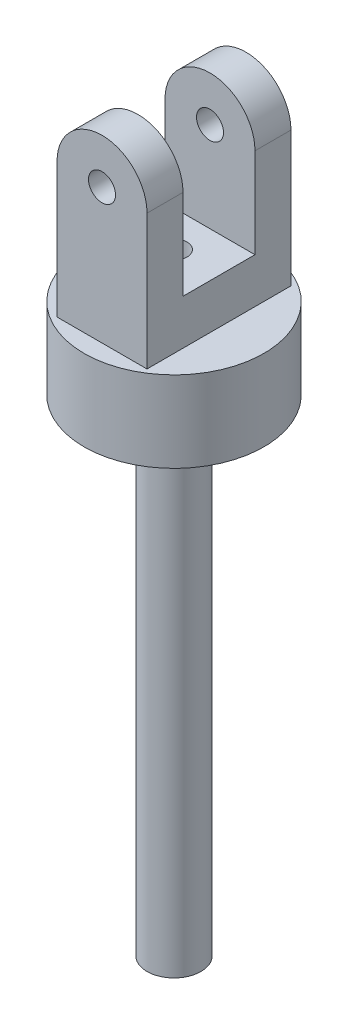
from build123d import *

# Parameters (mm, degrees)
SKETCH_1_W          = 10
SKETCH_1_H          = 4
EXTRUDE_1_DEPTH     = 15
EXTRUDE_1_2_DEPTH   = 15
SKETCH_1_4_W        = 10
SKETCH_1_4_H        = 8
SKETCH_1_4_H_2      = 4
EXTRUDE_2_DEPTH     = 4
CUT_EXTRUDE_3_REACH = 28.944
SKETCH_2_R          = 1.5
SKETCH_3_R          = 3
EXTRUDE_3_DEPTH     = 64
SKETCH_4_W          = 10
SKETCH_4_H          = 16
EXTRUDE_4_DEPTH     = 1
SKETCH_5_R          = 3
EXTRUDE_5_DEPTH     = 4
SKETCH_5_3_R        = 10
EXTRUDE_6_DEPTH     = 9
SKETCH_6_R          = 1.45
CUT_EXTRUDE_6_DEPTH = 87.332609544


with BuildPart() as part:
    # Sketch 1 → Extrude 1 (new body)
    with BuildSketch(Plane(origin=(0, 0, 0), x_dir=(1, 0, 0), z_dir=(0, 1, 0))):
        with Locations((-10.652173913, 4.260869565)):
            Rectangle(SKETCH_1_W, SKETCH_1_H)
    extrude(amount=EXTRUDE_1_DEPTH)



with BuildPart() as body_2:
    # Sketch 1 → Extrude 1 2 (new body)
    with BuildSketch(Plane(origin=(0, 0, 0), x_dir=(1, 0, 0), z_dir=(0, 1, 0))):
        with Locations((-10.652173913, -7.739130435)):
            Rectangle(SKETCH_1_W, SKETCH_1_H)
    extrude(amount=EXTRUDE_1_2_DEPTH)


with BuildPart() as part_1:
    add(part.part)

    add(body_2.part)  # Extrude 2 merges body 2
    # Sketch 1_4 → Extrude 2 (add)
    with BuildSketch(Plane(origin=(0, 0, 0), x_dir=(1, 0, 0), z_dir=(0, 1, 0))):
        with Locations((-10.652173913, -1.739130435)):
            Rectangle(SKETCH_1_4_W, SKETCH_1_4_H)
        with Locations((-10.652173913, -7.739130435)):
            Rectangle(SKETCH_1_4_W, SKETCH_1_4_H_2)
        with Locations((-10.652173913, 4.260869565)):
            Rectangle(SKETCH_1_4_W, SKETCH_1_4_H_2)
    extrude(amount=-EXTRUDE_2_DEPTH)

    # Cut-Extrude 3: up to this face of the body (flat: up to its plane)
    cut_extrude_3_end = Plane(part_1.part.faces().sort_by_distance((-10.652173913, 5.5, -6.260869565))[0])
    # Sketch 2 → Cut-Extrude 3 (cut, up to the picked face)
    with BuildSketch(Plane.XY.offset(9.739130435), mode=Mode.PRIVATE) as cut_extrude_3_sk1:
        with Locations((-10.652173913, 10)):
            Circle(SKETCH_2_R)
    cut_extrude_3_tool1 = split(extrude(cut_extrude_3_sk1.sketch, amount=-CUT_EXTRUDE_3_REACH, mode=Mode.PRIVATE), bisect_by=cut_extrude_3_end, keep=Keep.BOTH, mode=Mode.PRIVATE)
    # Sketch 2 → Cut-Extrude 3 (cut, up to the picked face)
    with BuildSketch(Plane.XY.offset(9.739130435), mode=Mode.PRIVATE) as cut_extrude_3_sk2:
        with BuildLine():
            Line((-15.652173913, 15), (-15.652173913, 10))
            ThreePointArc((-15.652173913, 10), (-14.187707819, 13.535533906), (-10.652173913, 15))
            Line((-10.652173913, 15), (-15.652173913, 15))
        make_face()
    cut_extrude_3_tool2 = split(extrude(cut_extrude_3_sk2.sketch, amount=-CUT_EXTRUDE_3_REACH, mode=Mode.PRIVATE), bisect_by=cut_extrude_3_end, keep=Keep.BOTH, mode=Mode.PRIVATE)
    # Sketch 2 → Cut-Extrude 3 (cut, up to the picked face)
    with BuildSketch(Plane.XY.offset(9.739130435), mode=Mode.PRIVATE) as cut_extrude_3_sk3:
        with BuildLine():
            ThreePointArc((-10.652173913, 15), (-7.116640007, 13.535533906), (-5.652173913, 10))
            Line((-5.652173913, 10), (-5.652173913, 15))
            Line((-5.652173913, 15), (-10.652173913, 15))
        make_face()
    cut_extrude_3_tool3 = split(extrude(cut_extrude_3_sk3.sketch, amount=-CUT_EXTRUDE_3_REACH, mode=Mode.PRIVATE), bisect_by=cut_extrude_3_end, keep=Keep.BOTH, mode=Mode.PRIVATE)
    add(cut_extrude_3_tool1.solids().sort_by(Axis((-10.652174, 10, 9.73913), (0, 0, -1)))[0], mode=Mode.SUBTRACT)
    add(cut_extrude_3_tool2.solids().sort_by(Axis((-14.535334, 13.88316, 9.73913), (0, 0, -1)))[0], mode=Mode.SUBTRACT)
    add(cut_extrude_3_tool3.solids().sort_by(Axis((-6.769014, 13.88316, 9.73913), (0, 0, -1)))[0], mode=Mode.SUBTRACT)

    # Sketch 3 → Extrude 3 (add)
    with BuildSketch(Plane.XZ.offset(4)):
        with Locations(Location((-10.652173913, 1.739130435, 0), (0, 0, 270))):
            Circle(SKETCH_3_R)
    extrude(amount=EXTRUDE_3_DEPTH)

    # Sketch 4 → Extrude 4 (add)
    with BuildSketch(Plane.XZ.offset(4)):
        with Locations((-10.652173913, 1.739130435)):
            Rectangle(SKETCH_4_W, SKETCH_4_H)
    extrude(amount=EXTRUDE_4_DEPTH)

    # Sketch 5 → Extrude 5 (add)
    # profile 1 of 3: a face of its own
    with BuildSketch(Plane.XZ.offset(5)):
        with BuildLine():
            Line((-15.652173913, -4.505867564), (-15.652173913, 7.984128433))
            ThreePointArc((-15.652173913, 7.984128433), (-18.652173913, 1.739130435), (-15.652173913, -4.505867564))
        make_face()
    # profile 2 of 3: a face of its own
    with BuildSketch(Plane.XZ.offset(5)):
        with BuildLine():
            ThreePointArc((-5.652173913, 7.984128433), (-8.002644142, 9.287639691), (-10.652173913, 9.739130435))
            ThreePointArc((-10.652173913, 9.739130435), (-13.301703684, 9.287639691), (-15.652173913, 7.984128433))
            Line((-15.652173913, 7.984128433), (-15.652173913, -4.505867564))
            ThreePointArc((-15.652173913, -4.505867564), (-13.301703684, -5.809378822), (-10.652173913, -6.260869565))
            ThreePointArc((-10.652173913, -6.260869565), (-8.002644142, -5.809378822), (-5.652173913, -4.505867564))
            Line((-5.652173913, -4.505867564), (-5.652173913, 7.984128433))
        make_face()
        with Locations(Location((-10.652173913, 1.739130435, 0), (0, 0, 270))):
            Circle(SKETCH_5_R, mode=Mode.SUBTRACT)
    # profile 3 of 3: a face of its own
    with BuildSketch(Plane.XZ.offset(5)):
        with BuildLine():
            ThreePointArc((-2.652173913, 1.739130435), (-3.441071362, 5.20323205), (-5.652173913, 7.984128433))
            Line((-5.652173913, 7.984128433), (-5.652173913, -4.505867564))
            ThreePointArc((-5.652173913, -4.505867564), (-3.441071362, -1.72497118), (-2.652173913, 1.739130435))
        make_face()
    extrude(amount=EXTRUDE_5_DEPTH)

    # Sketch 5_3 → Extrude 6 (add)
    # profile 1 of 5: a face of its own
    with BuildSketch(Plane.XZ.offset(5)):
        with Locations(Location((-10.652173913, 1.739130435, 0), (0, 0, 270))):
            Circle(SKETCH_5_3_R)
        with BuildLine():
            Line((-10.652173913, 9.739130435), (-5.652173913, 9.739130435))
            Line((-5.652173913, 9.739130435), (-5.652173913, 7.984128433))
            ThreePointArc((-5.652173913, 7.984128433), (-3.441071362, 5.20323205), (-2.652173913, 1.739130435))
            ThreePointArc((-2.652173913, 1.739130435), (-3.441071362, -1.72497118), (-5.652173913, -4.505867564))
            Line((-5.652173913, -4.505867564), (-5.652173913, -6.260869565))
            Line((-5.652173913, -6.260869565), (-10.652173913, -6.260869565))
            Line((-10.652173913, -6.260869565), (-15.652173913, -6.260869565))
            Line((-15.652173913, -6.260869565), (-15.652173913, -4.505867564))
            ThreePointArc((-15.652173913, -4.505867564), (-18.652173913, 1.739130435), (-15.652173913, 7.984128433))
            Line((-15.652173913, 7.984128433), (-15.652173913, 9.739130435))
            Line((-15.652173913, 9.739130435), (-10.652173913, 9.739130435))
        make_face(mode=Mode.SUBTRACT)
    # profile 2 of 5: a face of its own
    with BuildSketch(Plane.XZ.offset(5)):
        with BuildLine():
            ThreePointArc((-15.652173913, 7.984128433), (-13.301703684, 9.287639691), (-10.652173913, 9.739130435))
            Line((-10.652173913, 9.739130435), (-15.652173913, 9.739130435))
            Line((-15.652173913, 9.739130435), (-15.652173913, 7.984128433))
        make_face()
    # profile 3 of 5: a face of its own
    with BuildSketch(Plane.XZ.offset(5)):
        with BuildLine():
            Line((-5.652173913, 7.984128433), (-5.652173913, 9.739130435))
            Line((-5.652173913, 9.739130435), (-10.652173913, 9.739130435))
            ThreePointArc((-10.652173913, 9.739130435), (-8.002644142, 9.287639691), (-5.652173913, 7.984128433))
        make_face()
    # profile 4 of 5: a face of its own
    with BuildSketch(Plane.XZ.offset(5)):
        with BuildLine():
            ThreePointArc((-10.652173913, -6.260869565), (-13.301703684, -5.809378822), (-15.652173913, -4.505867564))
            Line((-15.652173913, -4.505867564), (-15.652173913, -6.260869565))
            Line((-15.652173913, -6.260869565), (-10.652173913, -6.260869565))
        make_face()
    # profile 5 of 5: a face of its own
    with BuildSketch(Plane.XZ.offset(5)):
        with BuildLine():
            Line((-5.652173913, -6.260869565), (-5.652173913, -4.505867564))
            ThreePointArc((-5.652173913, -4.505867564), (-8.002644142, -5.809378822), (-10.652173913, -6.260869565))
            Line((-10.652173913, -6.260869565), (-5.652173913, -6.260869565))
        make_face()
    extrude(amount=EXTRUDE_6_DEPTH)

    # Sketch 6 → Cut-Extrude 6 (cut, through all)
    with BuildSketch(Plane.XZ.offset(68)):
        with Locations(Location((-10.652173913, 1.739130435, 0), (0, 0, 270))):
            Circle(SKETCH_6_R)
    extrude(amount=-CUT_EXTRUDE_6_DEPTH, mode=Mode.SUBTRACT)


solid = part_1.part
